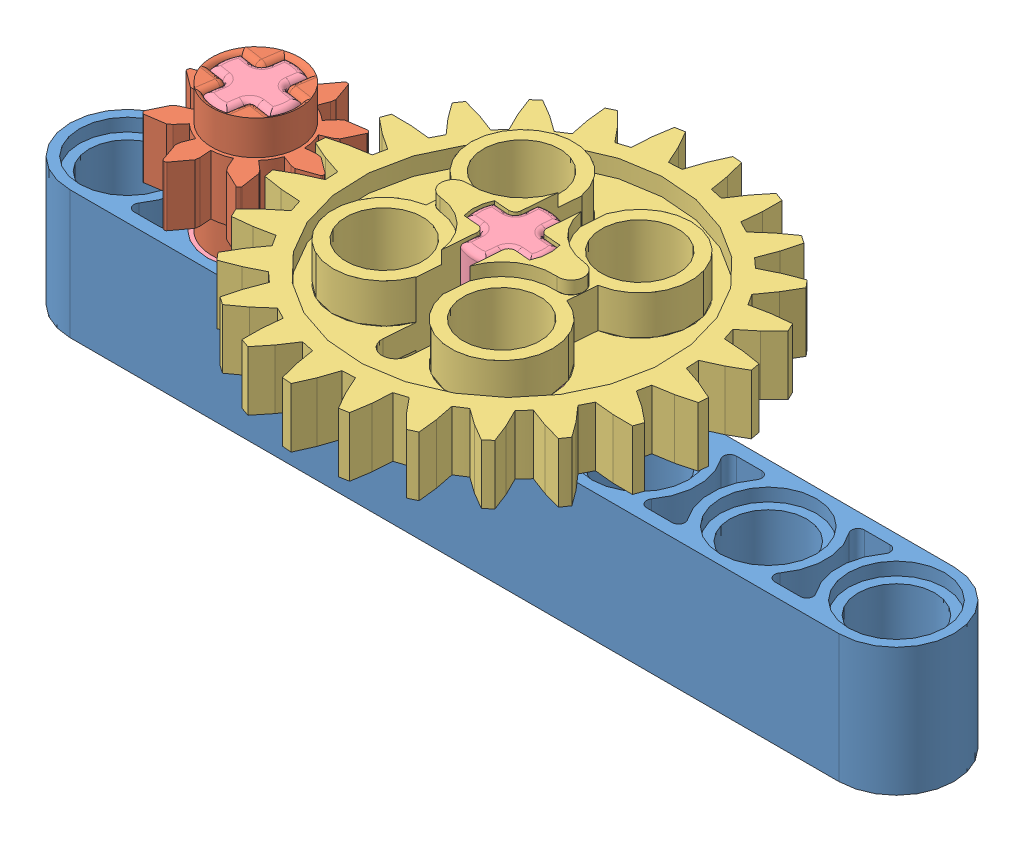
SolidWorks assembly 18.1.SLDASM, configuration Default (file format 12000). Lengths in mm.
Overall size (55.2 16 28.12).
5 component instances, 4 part files, 11 mates.
Components (placement in the parent):
- 32524 Beam 7 Blue-1: 32524 Beam 7 Blue.SLDPRT [Default] at (-2.9154 21.3458 44.4685) size (55.2 8 7.2)
- 3647 Gear 8-1: 3647 Gear 8.SLDPRT [Default] at (5.0846 33.3458 44.4685) x (-0.148168 0 0.988962) z (-0.988962 0 -0.148168) size (10.06 8 10.06)
- 3648 Gear 24-1: 3648 Gear 24.SLDPRT [Default] at (21.0846 33.3458 44.4685) x (-0.080825 0 0.996728) z (-0.996728 0 -0.080825) size (26.1 8 26.1)
- 3749 Axle Pin without Friction Ridges Lengthwise-1: 3749 Axle Pin without Friction Ridges Lengthwise.SLDPRT [Default] at (21.0846 29.3458 44.4685) x (-0.996728 0 -0.080825) z (0.080825 0 -0.996728) size (6 16 6)
- 3749 Axle Pin without Friction Ridges Lengthwise-2: 3749 Axle Pin without Friction Ridges Lengthwise.SLDPRT [Default] at (5.0846 29.3458 44.4685) x (0.148168 0 -0.988962) z (0.988962 0 0.148168) size (6 16 6)
Mates (geometry in assembly coordinates):
- Concentric1: concentric anti-aligned: cylinder of 32524 Beam 7 Blue-1 through (5.0846 29.3458 44.4685) axis (0 -1 0) radius 2.4; cylinder of 3749 Axle Pin without Friction Ridges Lengthwise-2 through (5.0846 21.3458 44.4685) axis (0 1 0) radius 2.4
- Coincident1: coincident anti-aligned: plane of 32524 Beam 7 Blue-1 through (5.0846 28.5458 44.4685) normal (0 1 0); plane of 3749 Axle Pin without Friction Ridges Lengthwise-2 through (5.0846 28.5458 44.4685) normal (0 -1 0)
- Concentric2: concentric anti-aligned: cylinder of 32524 Beam 7 Blue-1 through (21.0846 29.3458 44.4685) axis (0 -1 0) radius 2.4; cylinder of 3749 Axle Pin without Friction Ridges Lengthwise-1 through (21.0846 21.3458 44.4685) axis (0 1 0) radius 2.4
- Coincident2: coincident anti-aligned: circle of 32524 Beam 7 Blue-1; plane of 3749 Axle Pin without Friction Ridges Lengthwise-1 through (21.0846 28.5458 44.4685) normal (0 -1 0)
- Concentric3: concentric anti-aligned: cylinder of 3647 Gear 8-1 through (5.0846 29.3458 44.4685) axis (0 1 0) radius 2.4; cylinder of 3749 Axle Pin without Friction Ridges Lengthwise-2 through (5.0846 37.3458 44.4685) axis (0 -1 0) radius 2.4
- Coincident3: coincident anti-aligned: plane of 3647 Gear 8-1 through (5.5748 29.3458 42.9945) normal (-0.960713 0 0.277545); plane of 3749 Axle Pin without Friction Ridges Lengthwise-2 through (5.5748 37.3458 42.9945) normal (0.960713 0 -0.277545)
- Coincident4: coincident anti-aligned: plane of 32524 Beam 7 Blue-1 through (-2.9154 29.3458 44.4685) normal (0 1 0); plane of 3647 Gear 8-1 through (5.0846 29.3458 44.4685) normal (0 -1 0)
- Concentric4: concentric anti-aligned: cylinder of 3648 Gear 24-1 through (21.0846 29.3458 44.4685) axis (0 1 0) radius 2.4; cylinder of 3749 Axle Pin without Friction Ridges Lengthwise-1 through (21.0846 37.3458 44.4685) axis (0 -1 0) radius 2.4
- Coincident5: coincident anti-aligned: plane of 3648 Gear 24-1 through (20.2732 29.3458 45.793) normal (-0.406713 0 -0.913556); plane of 3749 Axle Pin without Friction Ridges Lengthwise-1 through (22.6119 37.3458 44.7518) normal (0.406713 0 0.913556)
- Coincident6: coincident anti-aligned: plane of 32524 Beam 7 Blue-1 through (-2.9154 29.3458 44.4685) normal (0 1 0); plane of 3648 Gear 24-1 through (17.4624 29.3458 46.1217) normal (0 -1 0)
- GearMate1: gear = 19.5 mm: cylinder of 3647 Gear 8-1 through (5.0846 37.3783 44.4685) axis (0 -1 0) radius 2.7325; circle of 3648 Gear 24-1
